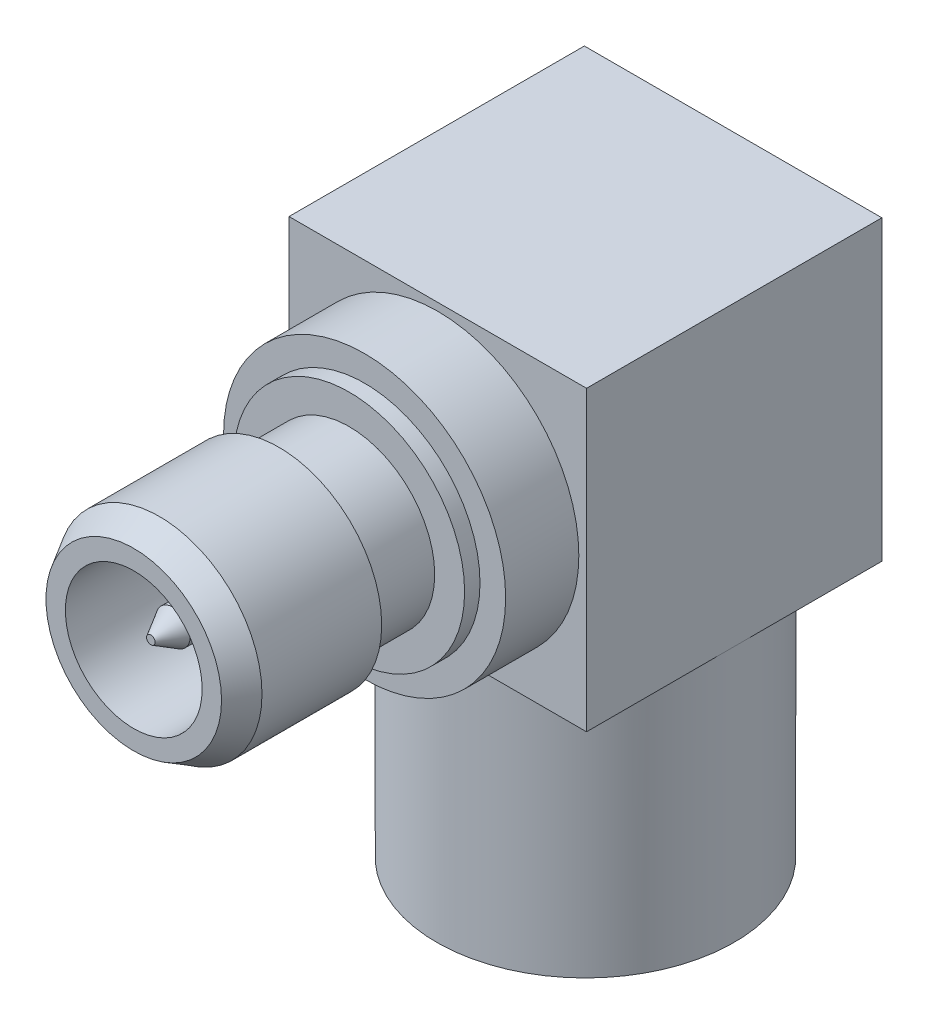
ISO-10303-21;
HEADER;
FILE_DESCRIPTION(('STEP AP214'),'2;1');
FILE_NAME('part.step','',(''),(''),'','','');
FILE_SCHEMA(('AUTOMOTIVE_DESIGN { 1 0 10303 214 1 1 1 1 }'));
ENDSEC;
DATA;
#1=APPLICATION_CONTEXT('core data for automotive mechanical design processes');
#2=APPLICATION_PROTOCOL_DEFINITION('international standard','automotive_design',2000,#1);
#3=PRODUCT_CONTEXT('',#1,'mechanical');
#4=PRODUCT('Part','Part','',(#3));
#5=PRODUCT_RELATED_PRODUCT_CATEGORY('part','',(#4));
#6=PRODUCT_DEFINITION_FORMATION('','',#4);
#7=PRODUCT_DEFINITION_CONTEXT('part definition',#1,'design');
#8=PRODUCT_DEFINITION('design','',#6,#7);
#9=PRODUCT_DEFINITION_SHAPE('','',#8);
#10=(LENGTH_UNIT() NAMED_UNIT(*) SI_UNIT(.MILLI.,.METRE.));
#11=(NAMED_UNIT(*) PLANE_ANGLE_UNIT() SI_UNIT($,.RADIAN.));
#12=(NAMED_UNIT(*) SI_UNIT($,.STERADIAN.) SOLID_ANGLE_UNIT());
#13=UNCERTAINTY_MEASURE_WITH_UNIT(LENGTH_MEASURE(1.E-05),#10,'distance_accuracy_value','');
#14=(GEOMETRIC_REPRESENTATION_CONTEXT(3) GLOBAL_UNCERTAINTY_ASSIGNED_CONTEXT((#13)) GLOBAL_UNIT_ASSIGNED_CONTEXT((#10,
#11,#12)) REPRESENTATION_CONTEXT('',''));
#15=CARTESIAN_POINT('',(0.,0.,0.));
#16=DIRECTION('',(0.,0.,1.));
#17=DIRECTION('',(1.,0.,0.));
#18=AXIS2_PLACEMENT_3D('',#15,#16,#17);
#19=CARTESIAN_POINT('',(1.7399,1.7399,-7.0104));
#20=DIRECTION('',(0.,0.,1.));
#21=DIRECTION('',(1.,0.,0.));
#22=AXIS2_PLACEMENT_3D('',#19,#20,#21);
#23=PLANE('',#22);
#24=DIRECTION('',(0.,1.,0.));
#25=VECTOR('',#24,1.);
#26=CARTESIAN_POINT('',(-1.7399,1.7399,-7.0104));
#27=LINE('',#26,#25);
#28=CARTESIAN_POINT('',(-1.7399,-1.7399,-7.0104));
#29=VERTEX_POINT('',#28);
#30=CARTESIAN_POINT('',(-1.7399,1.7399,-7.0104));
#31=VERTEX_POINT('',#30);
#32=EDGE_CURVE('E319',#29,#31,#27,.T.);
#33=ORIENTED_EDGE('',*,*,#32,.T.);
#34=DIRECTION('',(-1.,0.,0.));
#35=VECTOR('',#34,1.);
#36=CARTESIAN_POINT('',(1.7399,1.7399,-7.0104));
#37=LINE('',#36,#35);
#38=CARTESIAN_POINT('',(1.7399,1.7399,-7.0104));
#39=VERTEX_POINT('',#38);
#40=EDGE_CURVE('E147',#39,#31,#37,.T.);
#41=ORIENTED_EDGE('',*,*,#40,.F.);
#42=DIRECTION('',(0.,1.,0.));
#43=VECTOR('',#42,1.);
#44=CARTESIAN_POINT('',(1.7399,1.7399,-7.0104));
#45=LINE('',#44,#43);
#46=CARTESIAN_POINT('',(1.7399,-1.7399,-7.0104));
#47=VERTEX_POINT('',#46);
#48=EDGE_CURVE('E311',#47,#39,#45,.T.);
#49=ORIENTED_EDGE('',*,*,#48,.F.);
#50=DIRECTION('',(-1.,0.,0.));
#51=VECTOR('',#50,1.);
#52=CARTESIAN_POINT('',(1.7399,-1.7399,-7.0104));
#53=LINE('',#52,#51);
#54=CARTESIAN_POINT('',(0.209838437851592,-1.7399,-7.0104));
#55=VERTEX_POINT('',#54);
#56=EDGE_CURVE('E133',#47,#55,#53,.T.);
#57=ORIENTED_EDGE('',*,*,#56,.T.);
#58=CARTESIAN_POINT('',(-0.209838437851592,-1.7399,-7.0104));
#59=VERTEX_POINT('',#58);
#60=EDGE_CURVE('E126',#55,#59,#53,.T.);
#61=ORIENTED_EDGE('',*,*,#60,.T.);
#62=EDGE_CURVE('E129',#59,#29,#53,.T.);
#63=ORIENTED_EDGE('',*,*,#62,.T.);
#64=EDGE_LOOP('',(#33,#41,#49,#57,#61,#63));
#65=FACE_BOUND('',#64,.T.);
#66=CARTESIAN_POINT('',(0.,0.,-7.0104));
#67=DIRECTION('',(0.,0.,1.));
#68=DIRECTION('',(1.,0.,0.));
#69=AXIS2_PLACEMENT_3D('',#66,#67,#68);
#70=CIRCLE('',#69,1.524);
#71=CARTESIAN_POINT('',(1.524,0.,-7.0104));
#72=VERTEX_POINT('',#71);
#73=EDGE_CURVE('E340',#72,#72,#70,.T.);
#74=ORIENTED_EDGE('',*,*,#73,.T.);
#75=EDGE_LOOP('',(#74));
#76=FACE_BOUND('',#75,.T.);
#77=ADVANCED_FACE('F50',(#65,#76),#23,.F.);
#78=CARTESIAN_POINT('',(1.7399,-1.7399,-3.556));
#79=DIRECTION('',(0.,1.,0.));
#80=DIRECTION('',(0.,0.,1.));
#81=AXIS2_PLACEMENT_3D('',#78,#79,#80);
#82=PLANE('',#81);
#83=CARTESIAN_POINT('',(0.,-1.7399,-5.2832));
#84=DIRECTION('',(0.,-1.,0.));
#85=DIRECTION('',(0.,0.,-1.));
#86=AXIS2_PLACEMENT_3D('',#83,#84,#85);
#87=CIRCLE('',#86,1.7399);
#88=CARTESIAN_POINT('',(1.7399,-1.7399,-5.2832));
#89=VERTEX_POINT('',#88);
#90=EDGE_CURVE('E156',#55,#89,#87,.T.);
#91=ORIENTED_EDGE('',*,*,#90,.F.);
#92=ORIENTED_EDGE('',*,*,#56,.F.);
#93=DIRECTION('',(0.,0.,-1.));
#94=VECTOR('',#93,1.);
#95=CARTESIAN_POINT('',(1.7399,-1.7399,-3.556));
#96=LINE('',#95,#94);
#97=EDGE_CURVE('E305',#89,#47,#96,.T.);
#98=ORIENTED_EDGE('',*,*,#97,.F.);
#99=EDGE_LOOP('',(#91,#92,#98));
#100=FACE_BOUND('',#99,.T.);
#101=ADVANCED_FACE('F222',(#100),#82,.F.);
#102=CARTESIAN_POINT('',(0.209838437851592,-1.7399,-3.556));
#103=VERTEX_POINT('',#102);
#104=EDGE_CURVE('E165',#89,#103,#87,.T.);
#105=ORIENTED_EDGE('',*,*,#104,.F.);
#106=CARTESIAN_POINT('',(1.7399,-1.7399,-3.556));
#107=VERTEX_POINT('',#106);
#108=EDGE_CURVE('E307',#107,#89,#96,.T.);
#109=ORIENTED_EDGE('',*,*,#108,.F.);
#110=DIRECTION('',(-1.,0.,0.));
#111=VECTOR('',#110,1.);
#112=CARTESIAN_POINT('',(1.7399,-1.7399,-3.556));
#113=LINE('',#112,#111);
#114=EDGE_CURVE('E168',#107,#103,#113,.T.);
#115=ORIENTED_EDGE('',*,*,#114,.T.);
#116=EDGE_LOOP('',(#105,#109,#115));
#117=FACE_BOUND('',#116,.T.);
#118=ADVANCED_FACE('F227',(#117),#82,.F.);
#119=CARTESIAN_POINT('',(-0.209838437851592,-1.7399,-3.556));
#120=VERTEX_POINT('',#119);
#121=CARTESIAN_POINT('',(-1.7399,-1.7399,-5.2832));
#122=VERTEX_POINT('',#121);
#123=EDGE_CURVE('E69',#120,#122,#87,.T.);
#124=ORIENTED_EDGE('',*,*,#123,.F.);
#125=CARTESIAN_POINT('',(-1.7399,-1.7399,-3.556));
#126=VERTEX_POINT('',#125);
#127=EDGE_CURVE('E329',#120,#126,#113,.T.);
#128=ORIENTED_EDGE('',*,*,#127,.T.);
#129=DIRECTION('',(0.,0.,-1.));
#130=VECTOR('',#129,1.);
#131=CARTESIAN_POINT('',(-1.7399,-1.7399,-3.556));
#132=LINE('',#131,#130);
#133=EDGE_CURVE('E317',#126,#122,#132,.T.);
#134=ORIENTED_EDGE('',*,*,#133,.T.);
#135=EDGE_LOOP('',(#124,#128,#134));
#136=FACE_BOUND('',#135,.T.);
#137=ADVANCED_FACE('F245',(#136),#82,.F.);
#138=EDGE_CURVE('E142',#122,#59,#87,.T.);
#139=ORIENTED_EDGE('',*,*,#138,.F.);
#140=EDGE_CURVE('E144',#122,#29,#132,.T.);
#141=ORIENTED_EDGE('',*,*,#140,.T.);
#142=ORIENTED_EDGE('',*,*,#62,.F.);
#143=EDGE_LOOP('',(#139,#141,#142));
#144=FACE_BOUND('',#143,.T.);
#145=ADVANCED_FACE('F140',(#144),#82,.F.);
#146=CARTESIAN_POINT('',(1.7399,1.7399,-3.556));
#147=DIRECTION('',(0.,0.,-1.));
#148=DIRECTION('',(-1.,0.,0.));
#149=AXIS2_PLACEMENT_3D('',#146,#147,#148);
#150=PLANE('',#149);
#151=DIRECTION('',(0.,-1.,0.));
#152=VECTOR('',#151,1.);
#153=CARTESIAN_POINT('',(-1.7399,1.7399,-3.556));
#154=LINE('',#153,#152);
#155=CARTESIAN_POINT('',(-1.7399,1.7399,-3.556));
#156=VERTEX_POINT('',#155);
#157=EDGE_CURVE('E250',#156,#126,#154,.T.);
#158=ORIENTED_EDGE('',*,*,#157,.T.);
#159=ORIENTED_EDGE('',*,*,#127,.F.);
#160=EDGE_CURVE('E77',#103,#120,#113,.T.);
#161=ORIENTED_EDGE('',*,*,#160,.F.);
#162=ORIENTED_EDGE('',*,*,#114,.F.);
#163=DIRECTION('',(0.,-1.,0.));
#164=VECTOR('',#163,1.);
#165=CARTESIAN_POINT('',(1.7399,1.7399,-3.556));
#166=LINE('',#165,#164);
#167=CARTESIAN_POINT('',(1.7399,1.7399,-3.556));
#168=VERTEX_POINT('',#167);
#169=EDGE_CURVE('E301',#168,#107,#166,.T.);
#170=ORIENTED_EDGE('',*,*,#169,.F.);
#171=DIRECTION('',(-1.,0.,0.));
#172=VECTOR('',#171,1.);
#173=CARTESIAN_POINT('',(1.7399,1.7399,-3.556));
#174=LINE('',#173,#172);
#175=EDGE_CURVE('E315',#168,#156,#174,.T.);
#176=ORIENTED_EDGE('',*,*,#175,.T.);
#177=EDGE_LOOP('',(#158,#159,#161,#162,#170,#176));
#178=FACE_BOUND('',#177,.T.);
#179=CARTESIAN_POINT('',(0.,0.,-3.556));
#180=DIRECTION('',(0.,0.,-1.));
#181=DIRECTION('',(-1.,0.,0.));
#182=AXIS2_PLACEMENT_3D('',#179,#180,#181);
#183=CIRCLE('',#182,1.65);
#184=CARTESIAN_POINT('',(-1.65,0.,-3.556));
#185=VERTEX_POINT('',#184);
#186=EDGE_CURVE('E161',#185,#185,#183,.F.);
#187=ORIENTED_EDGE('',*,*,#186,.F.);
#188=EDGE_LOOP('',(#187));
#189=FACE_BOUND('',#188,.T.);
#190=ADVANCED_FACE('F237',(#178,#189),#150,.F.);
#191=CARTESIAN_POINT('',(1.7399,1.7399,-3.556));
#192=DIRECTION('',(0.,-1.,0.));
#193=DIRECTION('',(0.,0.,-1.));
#194=AXIS2_PLACEMENT_3D('',#191,#192,#193);
#195=PLANE('',#194);
#196=DIRECTION('',(0.,0.,1.));
#197=VECTOR('',#196,1.);
#198=CARTESIAN_POINT('',(-1.7399,1.7399,-3.556));
#199=LINE('',#198,#197);
#200=EDGE_CURVE('E306',#31,#156,#199,.T.);
#201=ORIENTED_EDGE('',*,*,#200,.T.);
#202=ORIENTED_EDGE('',*,*,#175,.F.);
#203=DIRECTION('',(0.,0.,1.));
#204=VECTOR('',#203,1.);
#205=CARTESIAN_POINT('',(1.7399,1.7399,-3.556));
#206=LINE('',#205,#204);
#207=EDGE_CURVE('E313',#39,#168,#206,.T.);
#208=ORIENTED_EDGE('',*,*,#207,.F.);
#209=ORIENTED_EDGE('',*,*,#40,.T.);
#210=EDGE_LOOP('',(#201,#202,#208,#209));
#211=FACE_BOUND('',#210,.T.);
#212=ADVANCED_FACE('F231',(#211),#195,.F.);
#213=CARTESIAN_POINT('',(1.7399,0.,0.));
#214=DIRECTION('',(1.,0.,0.));
#215=DIRECTION('',(0.,0.,-1.));
#216=AXIS2_PLACEMENT_3D('',#213,#214,#215);
#217=PLANE('',#216);
#218=ORIENTED_EDGE('',*,*,#169,.T.);
#219=ORIENTED_EDGE('',*,*,#108,.T.);
#220=ORIENTED_EDGE('',*,*,#97,.T.);
#221=ORIENTED_EDGE('',*,*,#48,.T.);
#222=ORIENTED_EDGE('',*,*,#207,.T.);
#223=EDGE_LOOP('',(#218,#219,#220,#221,#222));
#224=FACE_BOUND('',#223,.T.);
#225=ADVANCED_FACE('F243',(#224),#217,.T.);
#226=CARTESIAN_POINT('',(-1.7399,0.,0.));
#227=DIRECTION('',(1.,0.,0.));
#228=DIRECTION('',(0.,0.,-1.));
#229=AXIS2_PLACEMENT_3D('',#226,#227,#228);
#230=PLANE('',#229);
#231=ORIENTED_EDGE('',*,*,#157,.F.);
#232=ORIENTED_EDGE('',*,*,#200,.F.);
#233=ORIENTED_EDGE('',*,*,#32,.F.);
#234=ORIENTED_EDGE('',*,*,#140,.F.);
#235=ORIENTED_EDGE('',*,*,#133,.F.);
#236=EDGE_LOOP('',(#231,#232,#233,#234,#235));
#237=FACE_BOUND('',#236,.T.);
#238=ADVANCED_FACE('F257',(#237),#230,.F.);
#239=CARTESIAN_POINT('',(0.,0.,1.16690475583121));
#240=DIRECTION('',(0.,0.,-1.));
#241=DIRECTION('',(-1.,0.,0.));
#242=AXIS2_PLACEMENT_3D('',#239,#240,#241);
#243=CYLINDRICAL_SURFACE('',#242,1.65);
#244=CARTESIAN_POINT('',(0.,0.,-2.7));
#245=DIRECTION('',(0.,0.,1.));
#246=DIRECTION('',(1.,0.,0.));
#247=AXIS2_PLACEMENT_3D('',#244,#245,#246);
#248=CIRCLE('',#247,1.65);
#249=CARTESIAN_POINT('',(-1.65,0.,-2.7));
#250=VERTEX_POINT('',#249);
#251=EDGE_CURVE('E262',#250,#250,#248,.F.);
#252=CARTESIAN_POINT('',(-1.65,0.,-3.556));
#253=CARTESIAN_POINT('',(-1.65,0.,-3.54708333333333));
#254=CARTESIAN_POINT('',(-1.65,0.,-3.53816666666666));
#255=CARTESIAN_POINT('',(-1.65,0.,-3.52033333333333));
#256=CARTESIAN_POINT('',(-1.65,0.,-3.51141666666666));
#257=CARTESIAN_POINT('',(-1.65,0.,-3.49358333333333));
#258=CARTESIAN_POINT('',(-1.65,0.,-3.48466666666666));
#259=CARTESIAN_POINT('',(-1.65,0.,-3.46683333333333));
#260=CARTESIAN_POINT('',(-1.65,0.,-3.45791666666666));
#261=CARTESIAN_POINT('',(-1.65,0.,-3.44008333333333));
#262=CARTESIAN_POINT('',(-1.65,0.,-3.43116666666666));
#263=CARTESIAN_POINT('',(-1.65,0.,-3.41333333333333));
#264=CARTESIAN_POINT('',(-1.65,0.,-3.40441666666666));
#265=CARTESIAN_POINT('',(-1.65,0.,-3.38658333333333));
#266=CARTESIAN_POINT('',(-1.65,0.,-3.37766666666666));
#267=CARTESIAN_POINT('',(-1.65,0.,-3.35983333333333));
#268=CARTESIAN_POINT('',(-1.65,0.,-3.35091666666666));
#269=CARTESIAN_POINT('',(-1.65,0.,-3.33308333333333));
#270=CARTESIAN_POINT('',(-1.65,0.,-3.32416666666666));
#271=CARTESIAN_POINT('',(-1.65,0.,-3.30633333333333));
#272=CARTESIAN_POINT('',(-1.65,0.,-3.29741666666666));
#273=CARTESIAN_POINT('',(-1.65,0.,-3.27958333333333));
#274=CARTESIAN_POINT('',(-1.65,0.,-3.27066666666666));
#275=CARTESIAN_POINT('',(-1.65,0.,-3.25283333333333));
#276=CARTESIAN_POINT('',(-1.65,0.,-3.24391666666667));
#277=CARTESIAN_POINT('',(-1.65,0.,-3.22608333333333));
#278=CARTESIAN_POINT('',(-1.65,0.,-3.21716666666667));
#279=CARTESIAN_POINT('',(-1.65,0.,-3.19933333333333));
#280=CARTESIAN_POINT('',(-1.65,0.,-3.19041666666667));
#281=CARTESIAN_POINT('',(-1.65,0.,-3.17258333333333));
#282=CARTESIAN_POINT('',(-1.65,0.,-3.16366666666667));
#283=CARTESIAN_POINT('',(-1.65,0.,-3.14583333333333));
#284=CARTESIAN_POINT('',(-1.65,0.,-3.13691666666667));
#285=CARTESIAN_POINT('',(-1.65,0.,-3.11908333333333));
#286=CARTESIAN_POINT('',(-1.65,0.,-3.11016666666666));
#287=CARTESIAN_POINT('',(-1.65,0.,-3.09233333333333));
#288=CARTESIAN_POINT('',(-1.65,0.,-3.08341666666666));
#289=CARTESIAN_POINT('',(-1.65,0.,-3.06558333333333));
#290=CARTESIAN_POINT('',(-1.65,0.,-3.05666666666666));
#291=CARTESIAN_POINT('',(-1.65,0.,-3.03883333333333));
#292=CARTESIAN_POINT('',(-1.65,0.,-3.02991666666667));
#293=CARTESIAN_POINT('',(-1.65,0.,-3.01208333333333));
#294=CARTESIAN_POINT('',(-1.65,0.,-3.00316666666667));
#295=CARTESIAN_POINT('',(-1.65,0.,-2.98533333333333));
#296=CARTESIAN_POINT('',(-1.65,0.,-2.97641666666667));
#297=CARTESIAN_POINT('',(-1.65,0.,-2.95858333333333));
#298=CARTESIAN_POINT('',(-1.65,0.,-2.94966666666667));
#299=CARTESIAN_POINT('',(-1.65,0.,-2.93183333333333));
#300=CARTESIAN_POINT('',(-1.65,0.,-2.92291666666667));
#301=CARTESIAN_POINT('',(-1.65,0.,-2.90508333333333));
#302=CARTESIAN_POINT('',(-1.65,0.,-2.89616666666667));
#303=CARTESIAN_POINT('',(-1.65,0.,-2.87833333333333));
#304=CARTESIAN_POINT('',(-1.65,0.,-2.86941666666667));
#305=CARTESIAN_POINT('',(-1.65,0.,-2.85158333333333));
#306=CARTESIAN_POINT('',(-1.65,0.,-2.84266666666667));
#307=CARTESIAN_POINT('',(-1.65,0.,-2.82483333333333));
#308=CARTESIAN_POINT('',(-1.65,0.,-2.81591666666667));
#309=CARTESIAN_POINT('',(-1.65,0.,-2.79808333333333));
#310=CARTESIAN_POINT('',(-1.65,0.,-2.78916666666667));
#311=CARTESIAN_POINT('',(-1.65,0.,-2.77133333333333));
#312=CARTESIAN_POINT('',(-1.65,0.,-2.76241666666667));
#313=CARTESIAN_POINT('',(-1.65,0.,-2.74458333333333));
#314=CARTESIAN_POINT('',(-1.65,0.,-2.73566666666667));
#315=CARTESIAN_POINT('',(-1.65,0.,-2.71783333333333));
#316=CARTESIAN_POINT('',(-1.65,0.,-2.70891666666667));
#317=CARTESIAN_POINT('',(-1.65,0.,-2.7));
#318=B_SPLINE_CURVE_WITH_KNOTS('',3,(#252,#253,#254,#255,#256,#257,#258,#259,#260,#261,#262,
#263,#264,#265,#266,#267,#268,#269,#270,#271,#272,#273,#274,#275,#276,#277,#278,#279,#280,#281,
#282,#283,#284,#285,#286,#287,#288,#289,#290,#291,#292,#293,#294,#295,#296,#297,#298,#299,#300,
#301,#302,#303,#304,#305,#306,#307,#308,#309,#310,#311,#312,#313,#314,#315,#316,#317),
.UNSPECIFIED.,.F.,.F.,(4,2,2,2,2,2,2,2,2,2,2,2,2,2,2,2,2,2,2,2,2,2,2,2,2,2,2,2,2,2,2,2,4),(0.,
0.0267499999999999,0.0534999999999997,0.0802499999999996,0.106999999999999,0.133749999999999,
0.160499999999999,0.187249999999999,0.213999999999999,0.240749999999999,0.267499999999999,
0.294249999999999,0.320999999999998,0.347749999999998,0.374499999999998,0.401249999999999,
0.427999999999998,0.454749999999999,0.481499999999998,0.508249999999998,0.534999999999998,
0.561749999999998,0.588499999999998,0.615249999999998,0.641999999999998,0.668749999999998,
0.695499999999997,0.722249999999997,0.748999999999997,0.775749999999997,0.802499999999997,
0.829249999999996,0.855999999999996),.UNSPECIFIED.);
#319=EDGE_CURVE('BSEAM253',#185,#250,#318,.T.);
#320=ORIENTED_EDGE('',*,*,#186,.T.);
#321=ORIENTED_EDGE('',*,*,#251,.T.);
#322=ORIENTED_EDGE('',*,*,#319,.T.);
#323=ORIENTED_EDGE('',*,*,#319,.F.);
#324=EDGE_LOOP('',(#320,#322,#321,#323));
#325=FACE_BOUND('',#324,.T.);
#326=ADVANCED_FACE('F253',(#325),#243,.T.);
#327=CARTESIAN_POINT('',(0.,0.,-0.2));
#328=DIRECTION('',(0.,0.,1.));
#329=DIRECTION('',(1.,0.,0.));
#330=AXIS2_PLACEMENT_3D('',#327,#328,#329);
#331=PLANE('',#330);
#332=CARTESIAN_POINT('',(0.,0.,-0.200000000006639));
#333=DIRECTION('',(0.,0.,-1.));
#334=DIRECTION('',(-1.,0.,0.));
#335=AXIS2_PLACEMENT_3D('',#332,#333,#334);
#336=CIRCLE('',#335,0.0499999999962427);
#337=CARTESIAN_POINT('',(-0.0499999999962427,0.,-0.200000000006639));
#338=VERTEX_POINT('',#337);
#339=EDGE_CURVE('E179',#338,#338,#336,.T.);
#340=ORIENTED_EDGE('',*,*,#339,.F.);
#341=EDGE_LOOP('',(#340));
#342=FACE_BOUND('',#341,.T.);
#343=ADVANCED_FACE('F256',(#342),#331,.T.);
#344=CARTESIAN_POINT('',(0.,0.,-0.459807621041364));
#345=DIRECTION('',(0.,0.,-1.));
#346=DIRECTION('',(-1.,0.,0.));
#347=AXIS2_PLACEMENT_3D('',#344,#345,#346);
#348=CONICAL_SURFACE('',#347,0.199999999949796,0.523598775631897);
#349=CARTESIAN_POINT('',(0.,0.,-0.4598076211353));
#350=DIRECTION('',(0.,0.,1.));
#351=DIRECTION('',(1.,0.,0.));
#352=AXIS2_PLACEMENT_3D('',#349,#350,#351);
#353=CIRCLE('',#352,0.2);
#354=CARTESIAN_POINT('',(-0.20000000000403,0.,-0.4598076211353));
#355=VERTEX_POINT('',#354);
#356=EDGE_CURVE('E277',#355,#355,#353,.F.);
#357=CARTESIAN_POINT('',(-0.0499999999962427,0.,-0.200000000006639));
#358=CARTESIAN_POINT('',(-0.0515624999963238,0.,-0.202706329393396));
#359=CARTESIAN_POINT('',(-0.0531249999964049,0.,-0.205412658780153));
#360=CARTESIAN_POINT('',(-0.0562499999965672,0.,-0.210825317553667));
#361=CARTESIAN_POINT('',(-0.0578124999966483,0.,-0.213531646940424));
#362=CARTESIAN_POINT('',(-0.0609374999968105,0.,-0.218944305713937));
#363=CARTESIAN_POINT('',(-0.0624999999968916,0.,-0.221650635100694));
#364=CARTESIAN_POINT('',(-0.0656249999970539,0.,-0.227063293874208));
#365=CARTESIAN_POINT('',(-0.067187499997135,0.,-0.229769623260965));
#366=CARTESIAN_POINT('',(-0.0703124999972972,0.,-0.235182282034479));
#367=CARTESIAN_POINT('',(-0.0718749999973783,0.,-0.237888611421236));
#368=CARTESIAN_POINT('',(-0.0749999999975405,0.,-0.243301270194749));
#369=CARTESIAN_POINT('',(-0.0765624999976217,0.,-0.246007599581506));
#370=CARTESIAN_POINT('',(-0.0796874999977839,0.,-0.25142025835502));
#371=CARTESIAN_POINT('',(-0.081249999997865,0.,-0.254126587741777));
#372=CARTESIAN_POINT('',(-0.0843749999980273,0.,-0.259539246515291));
#373=CARTESIAN_POINT('',(-0.0859374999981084,0.,-0.262245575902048));
#374=CARTESIAN_POINT('',(-0.0890624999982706,0.,-0.267658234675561));
#375=CARTESIAN_POINT('',(-0.0906249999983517,0.,-0.270364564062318));
#376=CARTESIAN_POINT('',(-0.093749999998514,0.,-0.275777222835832));
#377=CARTESIAN_POINT('',(-0.0953124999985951,0.,-0.278483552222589));
#378=CARTESIAN_POINT('',(-0.0984374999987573,0.,-0.283896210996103));
#379=CARTESIAN_POINT('',(-0.0999999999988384,0.,-0.286602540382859));
#380=CARTESIAN_POINT('',(-0.103124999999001,0.,-0.292015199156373));
#381=CARTESIAN_POINT('',(-0.104687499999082,0.,-0.29472152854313));
#382=CARTESIAN_POINT('',(-0.107812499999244,0.,-0.300134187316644));
#383=CARTESIAN_POINT('',(-0.109374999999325,0.,-0.302840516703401));
#384=CARTESIAN_POINT('',(-0.112499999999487,0.,-0.308253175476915));
#385=CARTESIAN_POINT('',(-0.114062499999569,0.,-0.310959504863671));
#386=CARTESIAN_POINT('',(-0.117187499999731,0.,-0.316372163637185));
#387=CARTESIAN_POINT('',(-0.118749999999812,0.,-0.319078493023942));
#388=CARTESIAN_POINT('',(-0.121874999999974,0.,-0.324491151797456));
#389=CARTESIAN_POINT('',(-0.123437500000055,0.,-0.327197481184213));
#390=CARTESIAN_POINT('',(-0.126562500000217,0.,-0.332610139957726));
#391=CARTESIAN_POINT('',(-0.128125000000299,0.,-0.335316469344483));
#392=CARTESIAN_POINT('',(-0.131250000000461,0.,-0.340729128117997));
#393=CARTESIAN_POINT('',(-0.132812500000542,0.,-0.343435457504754));
#394=CARTESIAN_POINT('',(-0.135937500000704,0.,-0.348848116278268));
#395=CARTESIAN_POINT('',(-0.137500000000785,0.,-0.351554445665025));
#396=CARTESIAN_POINT('',(-0.140625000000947,0.,-0.356967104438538));
#397=CARTESIAN_POINT('',(-0.142187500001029,0.,-0.359673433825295));
#398=CARTESIAN_POINT('',(-0.145312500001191,0.,-0.365086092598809));
#399=CARTESIAN_POINT('',(-0.146875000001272,0.,-0.367792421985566));
#400=CARTESIAN_POINT('',(-0.150000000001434,0.,-0.37320508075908));
#401=CARTESIAN_POINT('',(-0.151562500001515,0.,-0.375911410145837));
#402=CARTESIAN_POINT('',(-0.154687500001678,0.,-0.38132406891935));
#403=CARTESIAN_POINT('',(-0.156250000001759,0.,-0.384030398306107));
#404=CARTESIAN_POINT('',(-0.159375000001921,0.,-0.389443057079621));
#405=CARTESIAN_POINT('',(-0.160937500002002,0.,-0.392149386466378));
#406=CARTESIAN_POINT('',(-0.164062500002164,0.,-0.397562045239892));
#407=CARTESIAN_POINT('',(-0.165625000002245,0.,-0.400268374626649));
#408=CARTESIAN_POINT('',(-0.168750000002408,0.,-0.405681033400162));
#409=CARTESIAN_POINT('',(-0.170312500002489,0.,-0.408387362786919));
#410=CARTESIAN_POINT('',(-0.173437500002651,0.,-0.413800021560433));
#411=CARTESIAN_POINT('',(-0.175000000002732,0.,-0.41650635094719));
#412=CARTESIAN_POINT('',(-0.178125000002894,0.,-0.421919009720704));
#413=CARTESIAN_POINT('',(-0.179687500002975,0.,-0.42462533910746));
#414=CARTESIAN_POINT('',(-0.182812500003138,0.,-0.430037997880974));
#415=CARTESIAN_POINT('',(-0.184375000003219,0.,-0.432744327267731));
#416=CARTESIAN_POINT('',(-0.187500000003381,0.,-0.438156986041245));
#417=CARTESIAN_POINT('',(-0.189062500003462,0.,-0.440863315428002));
#418=CARTESIAN_POINT('',(-0.192187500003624,0.,-0.446275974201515));
#419=CARTESIAN_POINT('',(-0.193750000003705,0.,-0.448982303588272));
#420=CARTESIAN_POINT('',(-0.196875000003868,0.,-0.454394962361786));
#421=CARTESIAN_POINT('',(-0.198437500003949,0.,-0.457101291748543));
#422=CARTESIAN_POINT('',(-0.20000000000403,0.,-0.4598076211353));
#423=B_SPLINE_CURVE_WITH_KNOTS('',3,(#357,#358,#359,#360,#361,#362,#363,#364,#365,#366,#367,
#368,#369,#370,#371,#372,#373,#374,#375,#376,#377,#378,#379,#380,#381,#382,#383,#384,#385,#386,
#387,#388,#389,#390,#391,#392,#393,#394,#395,#396,#397,#398,#399,#400,#401,#402,#403,#404,#405,
#406,#407,#408,#409,#410,#411,#412,#413,#414,#415,#416,#417,#418,#419,#420,#421,#422),
.UNSPECIFIED.,.F.,.F.,(4,2,2,2,2,2,2,2,2,2,2,2,2,2,2,2,2,2,2,2,2,2,2,2,2,2,2,2,2,2,2,2,4),(0.,
0.00937499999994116,0.0187499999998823,0.0281249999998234,0.0374999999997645,0.0468749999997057,
0.0562499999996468,0.065624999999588,0.0749999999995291,0.0843749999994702,0.0937499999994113,
0.103124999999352,0.112499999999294,0.121874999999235,0.131249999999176,0.140624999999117,
0.149999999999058,0.159374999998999,0.16874999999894,0.178124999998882,0.187499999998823,
0.196874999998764,0.206249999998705,0.215624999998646,0.224999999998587,0.234374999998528,
0.24374999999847,0.253124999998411,0.262499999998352,0.271874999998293,0.281249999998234,
0.290624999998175,0.299999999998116),.UNSPECIFIED.);
#424=EDGE_CURVE('BSEAM406',#338,#355,#423,.T.);
#425=ORIENTED_EDGE('',*,*,#339,.T.);
#426=ORIENTED_EDGE('',*,*,#356,.F.);
#427=ORIENTED_EDGE('',*,*,#424,.T.);
#428=ORIENTED_EDGE('',*,*,#424,.F.);
#429=EDGE_LOOP('',(#425,#427,#426,#428));
#430=FACE_BOUND('',#429,.T.);
#431=ADVANCED_FACE('F406',(#430),#348,.T.);
#432=CARTESIAN_POINT('',(0.,0.,-3.675));
#433=DIRECTION('',(0.,0.,1.));
#434=DIRECTION('',(1.,0.,0.));
#435=AXIS2_PLACEMENT_3D('',#432,#433,#434);
#436=CYLINDRICAL_SURFACE('',#435,0.2);
#437=CARTESIAN_POINT('',(0.,0.,-1.32679491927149));
#438=DIRECTION('',(0.,0.,1.));
#439=DIRECTION('',(1.,0.,0.));
#440=AXIS2_PLACEMENT_3D('',#437,#438,#439);
#441=CIRCLE('',#440,0.2);
#442=CARTESIAN_POINT('',(0.2,0.,-1.32679491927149));
#443=VERTEX_POINT('',#442);
#444=EDGE_CURVE('E185',#443,#443,#441,.T.);
#445=ORIENTED_EDGE('',*,*,#444,.T.);
#446=EDGE_LOOP('',(#445));
#447=FACE_BOUND('',#446,.T.);
#448=ORIENTED_EDGE('',*,*,#356,.T.);
#449=EDGE_LOOP('',(#448));
#450=FACE_BOUND('',#449,.T.);
#451=ADVANCED_FACE('F414',(#447,#450),#436,.T.);
#452=CARTESIAN_POINT('',(0.,0.,-1.5));
#453=DIRECTION('',(0.,0.,1.));
#454=DIRECTION('',(1.,0.,0.));
#455=AXIS2_PLACEMENT_3D('',#452,#453,#454);
#456=PLANE('',#455);
#457=CARTESIAN_POINT('',(0.,0.,-1.5));
#458=DIRECTION('',(0.,0.,1.));
#459=DIRECTION('',(1.,0.,0.));
#460=AXIS2_PLACEMENT_3D('',#457,#458,#459);
#461=CIRCLE('',#460,0.299999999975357);
#462=CARTESIAN_POINT('',(0.299999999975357,0.,-1.5));
#463=VERTEX_POINT('',#462);
#464=EDGE_CURVE('E190',#463,#463,#461,.F.);
#465=ORIENTED_EDGE('',*,*,#464,.T.);
#466=EDGE_LOOP('',(#465));
#467=FACE_BOUND('',#466,.T.);
#468=CARTESIAN_POINT('',(0.,0.,-1.49999999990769));
#469=DIRECTION('',(0.,0.,-1.));
#470=DIRECTION('',(-1.,0.,0.));
#471=AXIS2_PLACEMENT_3D('',#468,#469,#470);
#472=CIRCLE('',#471,0.549999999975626);
#473=CARTESIAN_POINT('',(-0.549999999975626,0.,-1.49999999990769));
#474=VERTEX_POINT('',#473);
#475=EDGE_CURVE('E280',#474,#474,#472,.T.);
#476=ORIENTED_EDGE('',*,*,#475,.F.);
#477=EDGE_LOOP('',(#476));
#478=FACE_BOUND('',#477,.T.);
#479=ADVANCED_FACE('F423',(#467,#478),#456,.T.);
#480=CARTESIAN_POINT('',(0.,0.,-1.59999999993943));
#481=DIRECTION('',(0.,0.,-1.));
#482=DIRECTION('',(-1.,0.,0.));
#483=AXIS2_PLACEMENT_3D('',#480,#481,#482);
#484=CONICAL_SURFACE('',#483,0.650000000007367,0.785398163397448);
#485=ORIENTED_EDGE('',*,*,#475,.T.);
#486=EDGE_LOOP('',(#485));
#487=FACE_BOUND('',#486,.T.);
#488=CARTESIAN_POINT('',(0.,0.,-1.6));
#489=DIRECTION('',(0.,0.,1.));
#490=DIRECTION('',(1.,0.,0.));
#491=AXIS2_PLACEMENT_3D('',#488,#489,#490);
#492=CIRCLE('',#491,0.65);
#493=CARTESIAN_POINT('',(0.65,0.,-1.6));
#494=VERTEX_POINT('',#493);
#495=EDGE_CURVE('E292',#494,#494,#492,.T.);
#496=ORIENTED_EDGE('',*,*,#495,.T.);
#497=EDGE_LOOP('',(#496));
#498=FACE_BOUND('',#497,.T.);
#499=ADVANCED_FACE('F431',(#487,#498),#484,.T.);
#500=CARTESIAN_POINT('',(0.,0.,-3.675));
#501=DIRECTION('',(0.,0.,1.));
#502=DIRECTION('',(1.,0.,0.));
#503=AXIS2_PLACEMENT_3D('',#500,#501,#502);
#504=CYLINDRICAL_SURFACE('',#503,0.65);
#505=ORIENTED_EDGE('',*,*,#495,.F.);
#506=EDGE_LOOP('',(#505));
#507=FACE_BOUND('',#506,.T.);
#508=CARTESIAN_POINT('',(0.,0.,-1.5));
#509=DIRECTION('',(0.,0.,1.));
#510=DIRECTION('',(1.,0.,0.));
#511=AXIS2_PLACEMENT_3D('',#508,#509,#510);
#512=CIRCLE('',#511,0.65);
#513=CARTESIAN_POINT('',(0.65,0.,-1.5));
#514=VERTEX_POINT('',#513);
#515=EDGE_CURVE('E291',#514,#514,#512,.F.);
#516=ORIENTED_EDGE('',*,*,#515,.F.);
#517=EDGE_LOOP('',(#516));
#518=FACE_BOUND('',#517,.T.);
#519=ADVANCED_FACE('F440',(#507,#518),#504,.F.);
#520=CARTESIAN_POINT('',(0.,0.,-1.5));
#521=DIRECTION('',(0.,0.,1.));
#522=DIRECTION('',(1.,0.,0.));
#523=AXIS2_PLACEMENT_3D('',#520,#521,#522);
#524=PLANE('',#523);
#525=ORIENTED_EDGE('',*,*,#515,.T.);
#526=EDGE_LOOP('',(#525));
#527=FACE_BOUND('',#526,.T.);
#528=CARTESIAN_POINT('',(0.,0.,-1.5));
#529=DIRECTION('',(0.,0.,1.));
#530=DIRECTION('',(1.,0.,0.));
#531=AXIS2_PLACEMENT_3D('',#528,#529,#530);
#532=CIRCLE('',#531,0.8);
#533=CARTESIAN_POINT('',(0.8,0.,-1.5));
#534=VERTEX_POINT('',#533);
#535=EDGE_CURVE('E287',#534,#534,#532,.T.);
#536=ORIENTED_EDGE('',*,*,#535,.T.);
#537=EDGE_LOOP('',(#536));
#538=FACE_BOUND('',#537,.T.);
#539=ADVANCED_FACE('F447',(#527,#538),#524,.T.);
#540=CARTESIAN_POINT('',(0.,0.,-3.675));
#541=DIRECTION('',(0.,0.,1.));
#542=DIRECTION('',(1.,0.,0.));
#543=AXIS2_PLACEMENT_3D('',#540,#541,#542);
#544=CYLINDRICAL_SURFACE('',#543,0.8);
#545=CARTESIAN_POINT('',(0.,0.,0.));
#546=DIRECTION('',(0.,0.,1.));
#547=DIRECTION('',(1.,0.,0.));
#548=AXIS2_PLACEMENT_3D('',#545,#546,#547);
#549=CIRCLE('',#548,0.8);
#550=CARTESIAN_POINT('',(0.8,0.,0.));
#551=VERTEX_POINT('',#550);
#552=EDGE_CURVE('E286',#551,#551,#549,.F.);
#553=ORIENTED_EDGE('',*,*,#552,.F.);
#554=EDGE_LOOP('',(#553));
#555=FACE_BOUND('',#554,.T.);
#556=ORIENTED_EDGE('',*,*,#535,.F.);
#557=EDGE_LOOP('',(#556));
#558=FACE_BOUND('',#557,.T.);
#559=ADVANCED_FACE('F454',(#555,#558),#544,.F.);
#560=CARTESIAN_POINT('',(0.,0.,0.));
#561=DIRECTION('',(0.,0.,1.));
#562=DIRECTION('',(1.,0.,0.));
#563=AXIS2_PLACEMENT_3D('',#560,#561,#562);
#564=PLANE('',#563);
#565=CARTESIAN_POINT('',(0.,0.,0.));
#566=DIRECTION('',(0.,0.,1.));
#567=DIRECTION('',(1.,0.,0.));
#568=AXIS2_PLACEMENT_3D('',#565,#566,#567);
#569=CIRCLE('',#568,1.02679491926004);
#570=CARTESIAN_POINT('',(1.02679491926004,0.,0.));
#571=VERTEX_POINT('',#570);
#572=EDGE_CURVE('E59',#571,#571,#569,.T.);
#573=ORIENTED_EDGE('',*,*,#572,.T.);
#574=EDGE_LOOP('',(#573));
#575=FACE_BOUND('',#574,.T.);
#576=ORIENTED_EDGE('',*,*,#552,.T.);
#577=EDGE_LOOP('',(#576));
#578=FACE_BOUND('',#577,.T.);
#579=ADVANCED_FACE('F204',(#575,#578),#564,.T.);
#580=CARTESIAN_POINT('',(0.,0.,-3.675));
#581=DIRECTION('',(0.,0.,1.));
#582=DIRECTION('',(1.,0.,0.));
#583=AXIS2_PLACEMENT_3D('',#580,#581,#582);
#584=CYLINDRICAL_SURFACE('',#583,1.2);
#585=CARTESIAN_POINT('',(0.,0.,-0.299999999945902));
#586=DIRECTION('',(0.,0.,1.));
#587=DIRECTION('',(1.,0.,0.));
#588=AXIS2_PLACEMENT_3D('',#585,#586,#587);
#589=CIRCLE('',#588,1.2);
#590=CARTESIAN_POINT('',(1.2,0.,-0.299999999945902));
#591=VERTEX_POINT('',#590);
#592=EDGE_CURVE('E12',#591,#591,#589,.F.);
#593=ORIENTED_EDGE('',*,*,#592,.T.);
#594=EDGE_LOOP('',(#593));
#595=FACE_BOUND('',#594,.T.);
#596=CARTESIAN_POINT('',(0.,0.,-1.7));
#597=DIRECTION('',(0.,0.,1.));
#598=DIRECTION('',(1.,0.,0.));
#599=AXIS2_PLACEMENT_3D('',#596,#597,#598);
#600=CIRCLE('',#599,1.2);
#601=CARTESIAN_POINT('',(1.2,0.,-1.7));
#602=VERTEX_POINT('',#601);
#603=EDGE_CURVE('E281',#602,#602,#600,.T.);
#604=ORIENTED_EDGE('',*,*,#603,.T.);
#605=EDGE_LOOP('',(#604));
#606=FACE_BOUND('',#605,.T.);
#607=ADVANCED_FACE('F469',(#595,#606),#584,.T.);
#608=CARTESIAN_POINT('',(0.,0.,-1.7));
#609=DIRECTION('',(0.,0.,1.));
#610=DIRECTION('',(1.,0.,0.));
#611=AXIS2_PLACEMENT_3D('',#608,#609,#610);
#612=PLANE('',#611);
#613=CARTESIAN_POINT('',(0.,0.,-1.7));
#614=DIRECTION('',(0.,0.,1.));
#615=DIRECTION('',(1.,0.,0.));
#616=AXIS2_PLACEMENT_3D('',#613,#614,#615);
#617=CIRCLE('',#616,1.);
#618=CARTESIAN_POINT('',(1.,0.,-1.7));
#619=VERTEX_POINT('',#618);
#620=EDGE_CURVE('E285',#619,#619,#617,.F.);
#621=ORIENTED_EDGE('',*,*,#620,.F.);
#622=EDGE_LOOP('',(#621));
#623=FACE_BOUND('',#622,.T.);
#624=ORIENTED_EDGE('',*,*,#603,.F.);
#625=EDGE_LOOP('',(#624));
#626=FACE_BOUND('',#625,.T.);
#627=ADVANCED_FACE('F381',(#623,#626),#612,.F.);
#628=CARTESIAN_POINT('',(0.,0.,-3.675));
#629=DIRECTION('',(0.,0.,1.));
#630=DIRECTION('',(1.,0.,0.));
#631=AXIS2_PLACEMENT_3D('',#628,#629,#630);
#632=CYLINDRICAL_SURFACE('',#631,1.);
#633=CARTESIAN_POINT('',(0.,0.,-2.52));
#634=DIRECTION('',(0.,0.,1.));
#635=DIRECTION('',(1.,0.,0.));
#636=AXIS2_PLACEMENT_3D('',#633,#634,#635);
#637=CIRCLE('',#636,1.);
#638=CARTESIAN_POINT('',(1.,0.,-2.52));
#639=VERTEX_POINT('',#638);
#640=EDGE_CURVE('E361',#639,#639,#637,.F.);
#641=ORIENTED_EDGE('',*,*,#640,.F.);
#642=EDGE_LOOP('',(#641));
#643=FACE_BOUND('',#642,.T.);
#644=ORIENTED_EDGE('',*,*,#620,.T.);
#645=EDGE_LOOP('',(#644));
#646=FACE_BOUND('',#645,.T.);
#647=ADVANCED_FACE('F372',(#643,#646),#632,.T.);
#648=CARTESIAN_POINT('',(0.,0.,-2.52));
#649=DIRECTION('',(0.,0.,1.));
#650=DIRECTION('',(1.,0.,0.));
#651=AXIS2_PLACEMENT_3D('',#648,#649,#650);
#652=PLANE('',#651);
#653=ORIENTED_EDGE('',*,*,#640,.T.);
#654=EDGE_LOOP('',(#653));
#655=FACE_BOUND('',#654,.T.);
#656=CARTESIAN_POINT('',(0.,0.,-2.52));
#657=DIRECTION('',(0.,0.,1.));
#658=DIRECTION('',(1.,0.,0.));
#659=AXIS2_PLACEMENT_3D('',#656,#657,#658);
#660=CIRCLE('',#659,1.35);
#661=CARTESIAN_POINT('',(1.35,0.,-2.52));
#662=VERTEX_POINT('',#661);
#663=EDGE_CURVE('E273',#662,#662,#660,.F.);
#664=ORIENTED_EDGE('',*,*,#663,.F.);
#665=EDGE_LOOP('',(#664));
#666=FACE_BOUND('',#665,.T.);
#667=ADVANCED_FACE('F370',(#655,#666),#652,.T.);
#668=CARTESIAN_POINT('',(0.,0.,-3.675));
#669=DIRECTION('',(0.,0.,1.));
#670=DIRECTION('',(1.,0.,0.));
#671=AXIS2_PLACEMENT_3D('',#668,#669,#670);
#672=CYLINDRICAL_SURFACE('',#671,1.35);
#673=CARTESIAN_POINT('',(0.,0.,-2.7));
#674=DIRECTION('',(0.,0.,1.));
#675=DIRECTION('',(1.,0.,0.));
#676=AXIS2_PLACEMENT_3D('',#673,#674,#675);
#677=CIRCLE('',#676,1.35);
#678=CARTESIAN_POINT('',(1.35,0.,-2.7));
#679=VERTEX_POINT('',#678);
#680=EDGE_CURVE('E265',#679,#679,#677,.F.);
#681=ORIENTED_EDGE('',*,*,#680,.F.);
#682=EDGE_LOOP('',(#681));
#683=FACE_BOUND('',#682,.T.);
#684=ORIENTED_EDGE('',*,*,#663,.T.);
#685=EDGE_LOOP('',(#684));
#686=FACE_BOUND('',#685,.T.);
#687=ADVANCED_FACE('F368',(#683,#686),#672,.T.);
#688=CARTESIAN_POINT('',(0.,0.,-2.7));
#689=DIRECTION('',(0.,0.,1.));
#690=DIRECTION('',(1.,0.,0.));
#691=AXIS2_PLACEMENT_3D('',#688,#689,#690);
#692=PLANE('',#691);
#693=ORIENTED_EDGE('',*,*,#680,.T.);
#694=EDGE_LOOP('',(#693));
#695=FACE_BOUND('',#694,.T.);
#696=ORIENTED_EDGE('',*,*,#251,.F.);
#697=EDGE_LOOP('',(#696));
#698=FACE_BOUND('',#697,.T.);
#699=ADVANCED_FACE('F259',(#695,#698),#692,.T.);
#700=CARTESIAN_POINT('',(0.,-1.7399,-5.2832));
#701=DIRECTION('',(0.,-1.,0.));
#702=DIRECTION('',(0.,0.,-1.));
#703=AXIS2_PLACEMENT_3D('',#700,#701,#702);
#704=PLANE('',#703);
#705=EDGE_CURVE('E153',#103,#120,#87,.T.);
#706=ORIENTED_EDGE('',*,*,#705,.F.);
#707=ORIENTED_EDGE('',*,*,#160,.T.);
#708=EDGE_LOOP('',(#706,#707));
#709=FACE_BOUND('',#708,.T.);
#710=ADVANCED_FACE('F387',(#709),#704,.F.);
#711=CARTESIAN_POINT('',(0.,-16.1352803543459,-5.2832));
#712=DIRECTION('',(0.,1.,0.));
#713=DIRECTION('',(0.,0.,1.));
#714=AXIS2_PLACEMENT_3D('',#711,#712,#713);
#715=CYLINDRICAL_SURFACE('',#714,1.7399);
#716=ORIENTED_EDGE('',*,*,#90,.T.);
#717=ORIENTED_EDGE('',*,*,#104,.T.);
#718=ORIENTED_EDGE('',*,*,#705,.T.);
#719=ORIENTED_EDGE('',*,*,#123,.T.);
#720=ORIENTED_EDGE('',*,*,#138,.T.);
#721=EDGE_CURVE('E148',#59,#55,#87,.T.);
#722=ORIENTED_EDGE('',*,*,#721,.T.);
#723=EDGE_LOOP('',(#716,#717,#718,#719,#720,#722));
#724=FACE_BOUND('',#723,.T.);
#725=CARTESIAN_POINT('',(0.,-4.7371,-5.2832));
#726=DIRECTION('',(0.,-1.,0.));
#727=DIRECTION('',(0.,0.,-1.));
#728=AXIS2_PLACEMENT_3D('',#725,#726,#727);
#729=CIRCLE('',#728,1.7399);
#730=CARTESIAN_POINT('',(0.,-4.7371,-7.0231));
#731=VERTEX_POINT('',#730);
#732=EDGE_CURVE('E173',#731,#731,#729,.T.);
#733=ORIENTED_EDGE('',*,*,#732,.F.);
#734=EDGE_LOOP('',(#733));
#735=FACE_BOUND('',#734,.T.);
#736=ADVANCED_FACE('F157',(#724,#735),#715,.T.);
#737=ORIENTED_EDGE('',*,*,#60,.F.);
#738=ORIENTED_EDGE('',*,*,#721,.F.);
#739=EDGE_LOOP('',(#737,#738));
#740=FACE_BOUND('',#739,.T.);
#741=ADVANCED_FACE('F149',(#740),#704,.F.);
#742=CARTESIAN_POINT('',(0.,-16.1352803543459,-5.2832));
#743=DIRECTION('',(0.,1.,0.));
#744=DIRECTION('',(0.,0.,1.));
#745=AXIS2_PLACEMENT_3D('',#742,#743,#744);
#746=CYLINDRICAL_SURFACE('',#745,1.0922);
#747=CARTESIAN_POINT('',(0.,-1.7399,-5.2832));
#748=DIRECTION('',(0.,-1.,0.));
#749=DIRECTION('',(0.,0.,-1.));
#750=AXIS2_PLACEMENT_3D('',#747,#748,#749);
#751=CIRCLE('',#750,1.0922);
#752=CARTESIAN_POINT('',(0.,-1.7399,-6.3754));
#753=VERTEX_POINT('',#752);
#754=EDGE_CURVE('E154',#753,#753,#751,.T.);
#755=ORIENTED_EDGE('',*,*,#754,.F.);
#756=EDGE_LOOP('',(#755));
#757=FACE_BOUND('',#756,.T.);
#758=CARTESIAN_POINT('',(0.,-4.7371,-5.2832));
#759=DIRECTION('',(0.,-1.,0.));
#760=DIRECTION('',(0.,0.,-1.));
#761=AXIS2_PLACEMENT_3D('',#758,#759,#760);
#762=CIRCLE('',#761,1.0922);
#763=CARTESIAN_POINT('',(0.,-4.7371,-6.3754));
#764=VERTEX_POINT('',#763);
#765=EDGE_CURVE('E339',#764,#764,#762,.T.);
#766=ORIENTED_EDGE('',*,*,#765,.T.);
#767=EDGE_LOOP('',(#766));
#768=FACE_BOUND('',#767,.T.);
#769=ADVANCED_FACE('F585',(#757,#768),#746,.F.);
#770=CARTESIAN_POINT('',(1.7399,-4.7371,-3.556));
#771=DIRECTION('',(0.,-1.,0.));
#772=DIRECTION('',(0.,0.,-1.));
#773=AXIS2_PLACEMENT_3D('',#770,#771,#772);
#774=PLANE('',#773);
#775=ORIENTED_EDGE('',*,*,#765,.F.);
#776=EDGE_LOOP('',(#775));
#777=FACE_BOUND('',#776,.T.);
#778=ORIENTED_EDGE('',*,*,#732,.T.);
#779=EDGE_LOOP('',(#778));
#780=FACE_BOUND('',#779,.T.);
#781=ADVANCED_FACE('F235',(#777,#780),#774,.T.);
#782=ORIENTED_EDGE('',*,*,#754,.T.);
#783=EDGE_LOOP('',(#782));
#784=FACE_BOUND('',#783,.T.);
#785=ADVANCED_FACE('F218',(#784),#82,.F.);
#786=CARTESIAN_POINT('',(0.,0.,-1.32679491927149));
#787=DIRECTION('',(0.,0.,-1.));
#788=DIRECTION('',(-1.,0.,0.));
#789=AXIS2_PLACEMENT_3D('',#786,#787,#788);
#790=CONICAL_SURFACE('',#789,0.2,0.523598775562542);
#791=ORIENTED_EDGE('',*,*,#464,.F.);
#792=EDGE_LOOP('',(#791));
#793=FACE_BOUND('',#792,.T.);
#794=ORIENTED_EDGE('',*,*,#444,.F.);
#795=EDGE_LOOP('',(#794));
#796=FACE_BOUND('',#795,.T.);
#797=ADVANCED_FACE('F209',(#793,#796),#790,.T.);
#798=CARTESIAN_POINT('',(0.,0.,0.));
#799=DIRECTION('',(0.,0.,-1.));
#800=DIRECTION('',(-1.,0.,0.));
#801=AXIS2_PLACEMENT_3D('',#798,#799,#800);
#802=CONICAL_SURFACE('',#801,1.02679491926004,0.523598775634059);
#803=ORIENTED_EDGE('',*,*,#592,.F.);
#804=EDGE_LOOP('',(#803));
#805=FACE_BOUND('',#804,.T.);
#806=ORIENTED_EDGE('',*,*,#572,.F.);
#807=EDGE_LOOP('',(#806));
#808=FACE_BOUND('',#807,.T.);
#809=ADVANCED_FACE('F52',(#805,#808),#802,.T.);
#810=CARTESIAN_POINT('',(0.,0.,-6.9596));
#811=DIRECTION('',(0.,0.,-1.));
#812=DIRECTION('',(-1.,0.,0.));
#813=AXIS2_PLACEMENT_3D('',#810,#811,#812);
#814=CYLINDRICAL_SURFACE('',#813,1.524);
#815=CARTESIAN_POINT('',(0.,0.,-6.9596));
#816=DIRECTION('',(0.,0.,1.));
#817=DIRECTION('',(1.,0.,0.));
#818=AXIS2_PLACEMENT_3D('',#815,#816,#817);
#819=CIRCLE('',#818,1.524);
#820=CARTESIAN_POINT('',(1.524,0.,-6.9596));
#821=VERTEX_POINT('',#820);
#822=EDGE_CURVE('E336',#821,#821,#819,.T.);
#823=ORIENTED_EDGE('',*,*,#822,.T.);
#824=EDGE_LOOP('',(#823));
#825=FACE_BOUND('',#824,.T.);
#826=ORIENTED_EDGE('',*,*,#73,.F.);
#827=EDGE_LOOP('',(#826));
#828=FACE_BOUND('',#827,.T.);
#829=ADVANCED_FACE('F208',(#825,#828),#814,.F.);
#830=CARTESIAN_POINT('',(0.,0.,-6.9596));
#831=DIRECTION('',(0.,0.,1.));
#832=DIRECTION('',(1.,0.,0.));
#833=AXIS2_PLACEMENT_3D('',#830,#831,#832);
#834=PLANE('',#833);
#835=ORIENTED_EDGE('',*,*,#822,.F.);
#836=EDGE_LOOP('',(#835));
#837=FACE_BOUND('',#836,.T.);
#838=ADVANCED_FACE('F215',(#837),#834,.F.);
#839=CLOSED_SHELL('',(#77,#101,#118,#137,#145,#190,#212,#225,#238,#326,#343,#431,#451,#479,#499,
#519,#539,#559,#579,#607,#627,#647,#667,#687,#699,#710,#736,#741,#769,#781,#785,#797,#809,#829,#838));
#840=MANIFOLD_SOLID_BREP('B2',#839);
#841=ADVANCED_BREP_SHAPE_REPRESENTATION('',(#18,#840),#14);
#842=SHAPE_DEFINITION_REPRESENTATION(#9,#841);
ENDSEC;
END-ISO-10303-21;
